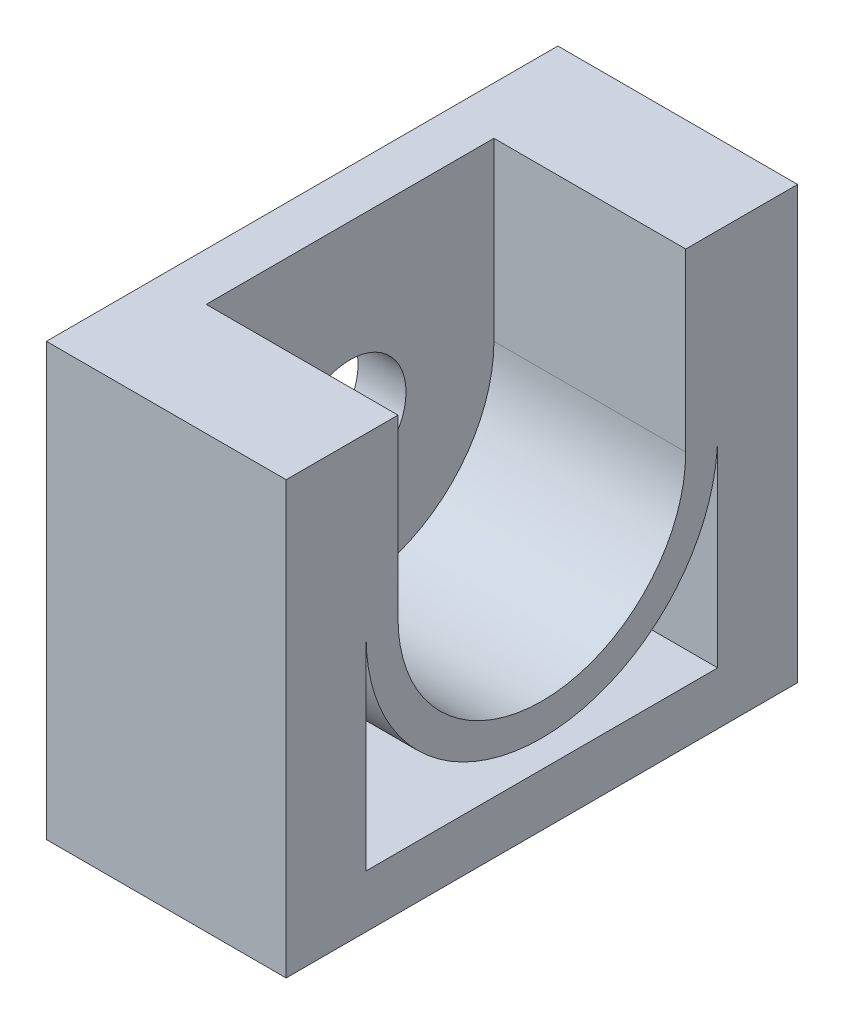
ISO-10303-21;
HEADER;
FILE_DESCRIPTION(('STEP AP214'),'2;1');
FILE_NAME('part.step','',(''),(''),'','','');
FILE_SCHEMA(('AUTOMOTIVE_DESIGN { 1 0 10303 214 1 1 1 1 }'));
ENDSEC;
DATA;
#1=APPLICATION_CONTEXT('core data for automotive mechanical design processes');
#2=APPLICATION_PROTOCOL_DEFINITION('international standard','automotive_design',2000,#1);
#3=PRODUCT_CONTEXT('',#1,'mechanical');
#4=PRODUCT('Part','Part','',(#3));
#5=PRODUCT_RELATED_PRODUCT_CATEGORY('part','',(#4));
#6=PRODUCT_DEFINITION_FORMATION('','',#4);
#7=PRODUCT_DEFINITION_CONTEXT('part definition',#1,'design');
#8=PRODUCT_DEFINITION('design','',#6,#7);
#9=PRODUCT_DEFINITION_SHAPE('','',#8);
#10=(LENGTH_UNIT() NAMED_UNIT(*) SI_UNIT(.MILLI.,.METRE.));
#11=(NAMED_UNIT(*) PLANE_ANGLE_UNIT() SI_UNIT($,.RADIAN.));
#12=(NAMED_UNIT(*) SI_UNIT($,.STERADIAN.) SOLID_ANGLE_UNIT());
#13=UNCERTAINTY_MEASURE_WITH_UNIT(LENGTH_MEASURE(1.E-05),#10,'distance_accuracy_value','');
#14=(GEOMETRIC_REPRESENTATION_CONTEXT(3) GLOBAL_UNCERTAINTY_ASSIGNED_CONTEXT((#13)) GLOBAL_UNIT_ASSIGNED_CONTEXT((#10,
#11,#12)) REPRESENTATION_CONTEXT('',''));
#15=CARTESIAN_POINT('',(0.,0.,0.));
#16=DIRECTION('',(0.,0.,1.));
#17=DIRECTION('',(1.,0.,0.));
#18=AXIS2_PLACEMENT_3D('',#15,#16,#17);
#19=CARTESIAN_POINT('',(15.,11.,11.));
#20=DIRECTION('',(0.,-1.,0.));
#21=DIRECTION('',(0.,0.,-1.));
#22=AXIS2_PLACEMENT_3D('',#19,#20,#21);
#23=PLANE('',#22);
#24=DIRECTION('',(1.,0.,0.));
#25=VECTOR('',#24,1.);
#26=CARTESIAN_POINT('',(3.,11.,9.));
#27=LINE('',#26,#25);
#28=CARTESIAN_POINT('',(3.,11.,9.));
#29=VERTEX_POINT('',#28);
#30=CARTESIAN_POINT('',(15.,11.,9.));
#31=VERTEX_POINT('',#30);
#32=EDGE_CURVE('E247',#29,#31,#27,.T.);
#33=ORIENTED_EDGE('',*,*,#32,.F.);
#34=DIRECTION('',(0.,0.,-1.));
#35=VECTOR('',#34,1.);
#36=CARTESIAN_POINT('',(3.,11.,9.));
#37=LINE('',#36,#35);
#38=CARTESIAN_POINT('',(3.,11.,-9.));
#39=VERTEX_POINT('',#38);
#40=EDGE_CURVE('E214',#29,#39,#37,.T.);
#41=ORIENTED_EDGE('',*,*,#40,.T.);
#42=DIRECTION('',(1.,0.,0.));
#43=VECTOR('',#42,1.);
#44=CARTESIAN_POINT('',(3.,11.,-9.));
#45=LINE('',#44,#43);
#46=CARTESIAN_POINT('',(15.,11.,-9.));
#47=VERTEX_POINT('',#46);
#48=EDGE_CURVE('E243',#39,#47,#45,.T.);
#49=ORIENTED_EDGE('',*,*,#48,.T.);
#50=DIRECTION('',(0.,0.,1.));
#51=VECTOR('',#50,1.);
#52=CARTESIAN_POINT('',(15.,11.,11.));
#53=LINE('',#52,#51);
#54=CARTESIAN_POINT('',(15.,11.,-16.));
#55=VERTEX_POINT('',#54);
#56=EDGE_CURVE('E256',#55,#47,#53,.T.);
#57=ORIENTED_EDGE('',*,*,#56,.F.);
#58=DIRECTION('',(-1.,0.,0.));
#59=VECTOR('',#58,1.);
#60=CARTESIAN_POINT('',(15.,11.,-16.));
#61=LINE('',#60,#59);
#62=CARTESIAN_POINT('',(0.,11.,-16.));
#63=VERTEX_POINT('',#62);
#64=EDGE_CURVE('E194',#55,#63,#61,.T.);
#65=ORIENTED_EDGE('',*,*,#64,.T.);
#66=DIRECTION('',(0.,0.,1.));
#67=VECTOR('',#66,1.);
#68=CARTESIAN_POINT('',(0.,11.,11.));
#69=LINE('',#68,#67);
#70=CARTESIAN_POINT('',(0.,11.,16.));
#71=VERTEX_POINT('',#70);
#72=EDGE_CURVE('E255',#63,#71,#69,.T.);
#73=ORIENTED_EDGE('',*,*,#72,.T.);
#74=DIRECTION('',(1.,0.,0.));
#75=VECTOR('',#74,1.);
#76=CARTESIAN_POINT('',(0.,11.,16.));
#77=LINE('',#76,#75);
#78=CARTESIAN_POINT('',(15.,11.,16.));
#79=VERTEX_POINT('',#78);
#80=EDGE_CURVE('E166',#71,#79,#77,.T.);
#81=ORIENTED_EDGE('',*,*,#80,.T.);
#82=EDGE_CURVE('E254',#31,#79,#53,.T.);
#83=ORIENTED_EDGE('',*,*,#82,.F.);
#84=EDGE_LOOP('',(#33,#41,#49,#57,#65,#73,#81,#83));
#85=FACE_BOUND('',#84,.T.);
#86=ADVANCED_FACE('F42',(#85),#23,.F.);
#87=CARTESIAN_POINT('',(15.,0.,0.));
#88=DIRECTION('',(1.,0.,0.));
#89=DIRECTION('',(0.,0.,-1.));
#90=AXIS2_PLACEMENT_3D('',#87,#88,#89);
#91=PLANE('',#90);
#92=DIRECTION('',(0.,1.,0.));
#93=VECTOR('',#92,1.);
#94=CARTESIAN_POINT('',(15.,-16.,-11.));
#95=LINE('',#94,#93);
#96=CARTESIAN_POINT('',(15.,-12.6971911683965,-11.));
#97=VERTEX_POINT('',#96);
#98=CARTESIAN_POINT('',(15.,0.,-11.));
#99=VERTEX_POINT('',#98);
#100=EDGE_CURVE('E188',#97,#99,#95,.T.);
#101=ORIENTED_EDGE('',*,*,#100,.F.);
#102=DIRECTION('',(0.,0.,1.));
#103=VECTOR('',#102,1.);
#104=CARTESIAN_POINT('',(15.,-12.6971911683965,-26.3593146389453));
#105=LINE('',#104,#103);
#106=CARTESIAN_POINT('',(15.,-12.6971911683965,11.));
#107=VERTEX_POINT('',#106);
#108=EDGE_CURVE('E138',#97,#107,#105,.T.);
#109=ORIENTED_EDGE('',*,*,#108,.T.);
#110=DIRECTION('',(0.,1.,0.));
#111=VECTOR('',#110,1.);
#112=CARTESIAN_POINT('',(15.,-16.,11.));
#113=LINE('',#112,#111);
#114=CARTESIAN_POINT('',(15.,0.,11.));
#115=VERTEX_POINT('',#114);
#116=EDGE_CURVE('E145',#107,#115,#113,.T.);
#117=ORIENTED_EDGE('',*,*,#116,.T.);
#118=CARTESIAN_POINT('',(15.,0.,0.));
#119=DIRECTION('',(1.,0.,0.));
#120=DIRECTION('',(0.,0.,-1.));
#121=AXIS2_PLACEMENT_3D('',#118,#119,#120);
#122=CIRCLE('',#121,11.);
#123=EDGE_CURVE('E250',#115,#99,#122,.T.);
#124=ORIENTED_EDGE('',*,*,#123,.T.);
#125=EDGE_LOOP('',(#101,#109,#117,#124));
#126=FACE_BOUND('',#125,.T.);
#127=CARTESIAN_POINT('',(15.,0.,0.));
#128=DIRECTION('',(1.,0.,0.));
#129=DIRECTION('',(0.,0.,-1.));
#130=AXIS2_PLACEMENT_3D('',#127,#128,#129);
#131=CIRCLE('',#130,9.);
#132=CARTESIAN_POINT('',(15.,0.,9.));
#133=VERTEX_POINT('',#132);
#134=CARTESIAN_POINT('',(15.,0.,-9.));
#135=VERTEX_POINT('',#134);
#136=EDGE_CURVE('E215',#133,#135,#131,.T.);
#137=ORIENTED_EDGE('',*,*,#136,.F.);
#138=DIRECTION('',(0.,1.,0.));
#139=VECTOR('',#138,1.);
#140=CARTESIAN_POINT('',(15.,0.,9.));
#141=LINE('',#140,#139);
#142=EDGE_CURVE('E206',#133,#31,#141,.T.);
#143=ORIENTED_EDGE('',*,*,#142,.T.);
#144=ORIENTED_EDGE('',*,*,#82,.T.);
#145=DIRECTION('',(0.,-1.,0.));
#146=VECTOR('',#145,1.);
#147=CARTESIAN_POINT('',(15.,11.,16.));
#148=LINE('',#147,#146);
#149=CARTESIAN_POINT('',(15.,-16.,16.));
#150=VERTEX_POINT('',#149);
#151=EDGE_CURVE('E158',#79,#150,#148,.T.);
#152=ORIENTED_EDGE('',*,*,#151,.T.);
#153=DIRECTION('',(0.,0.,-1.));
#154=VECTOR('',#153,1.);
#155=CARTESIAN_POINT('',(15.,-16.,-11.));
#156=LINE('',#155,#154);
#157=CARTESIAN_POINT('',(15.,-16.,-16.));
#158=VERTEX_POINT('',#157);
#159=EDGE_CURVE('E178',#150,#158,#156,.T.);
#160=ORIENTED_EDGE('',*,*,#159,.T.);
#161=DIRECTION('',(0.,-1.,0.));
#162=VECTOR('',#161,1.);
#163=CARTESIAN_POINT('',(15.,11.,-16.));
#164=LINE('',#163,#162);
#165=EDGE_CURVE('E198',#55,#158,#164,.T.);
#166=ORIENTED_EDGE('',*,*,#165,.F.);
#167=ORIENTED_EDGE('',*,*,#56,.T.);
#168=DIRECTION('',(0.,1.,0.));
#169=VECTOR('',#168,1.);
#170=CARTESIAN_POINT('',(15.,0.,-9.));
#171=LINE('',#170,#169);
#172=EDGE_CURVE('E231',#135,#47,#171,.T.);
#173=ORIENTED_EDGE('',*,*,#172,.F.);
#174=EDGE_LOOP('',(#137,#143,#144,#152,#160,#166,#167,#173));
#175=FACE_BOUND('',#174,.T.);
#176=ADVANCED_FACE('F268',(#126,#175),#91,.T.);
#177=CARTESIAN_POINT('',(15.,0.,0.));
#178=DIRECTION('',(-1.,0.,0.));
#179=DIRECTION('',(0.,0.,1.));
#180=AXIS2_PLACEMENT_3D('',#177,#178,#179);
#181=CYLINDRICAL_SURFACE('',#180,11.);
#182=CARTESIAN_POINT('',(0.,0.,0.));
#183=DIRECTION('',(1.,0.,0.));
#184=DIRECTION('',(0.,0.,-1.));
#185=AXIS2_PLACEMENT_3D('',#182,#183,#184);
#186=CIRCLE('',#185,11.);
#187=CARTESIAN_POINT('',(0.,0.,11.));
#188=VERTEX_POINT('',#187);
#189=CARTESIAN_POINT('',(0.,0.,-11.));
#190=VERTEX_POINT('',#189);
#191=EDGE_CURVE('E151',#188,#190,#186,.T.);
#192=ORIENTED_EDGE('',*,*,#191,.T.);
#193=DIRECTION('',(-1.,0.,0.));
#194=VECTOR('',#193,1.);
#195=CARTESIAN_POINT('',(15.,0.,-11.));
#196=LINE('',#195,#194);
#197=EDGE_CURVE('E11',#99,#190,#196,.T.);
#198=ORIENTED_EDGE('',*,*,#197,.F.);
#199=ORIENTED_EDGE('',*,*,#123,.F.);
#200=DIRECTION('',(-1.,0.,0.));
#201=VECTOR('',#200,1.);
#202=CARTESIAN_POINT('',(15.,0.,11.));
#203=LINE('',#202,#201);
#204=EDGE_CURVE('E51',#115,#188,#203,.T.);
#205=ORIENTED_EDGE('',*,*,#204,.T.);
#206=EDGE_LOOP('',(#192,#198,#199,#205));
#207=FACE_BOUND('',#206,.T.);
#208=ADVANCED_FACE('F44',(#207),#181,.T.);
#209=CARTESIAN_POINT('',(0.,0.,0.));
#210=DIRECTION('',(1.,0.,0.));
#211=DIRECTION('',(0.,0.,-1.));
#212=AXIS2_PLACEMENT_3D('',#209,#210,#211);
#213=PLANE('',#212);
#214=DIRECTION('',(0.,0.,1.));
#215=VECTOR('',#214,1.);
#216=CARTESIAN_POINT('',(0.,-12.6971911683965,-26.3593146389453));
#217=LINE('',#216,#215);
#218=CARTESIAN_POINT('',(0.,-12.6971911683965,-11.));
#219=VERTEX_POINT('',#218);
#220=CARTESIAN_POINT('',(0.,-12.6971911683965,11.));
#221=VERTEX_POINT('',#220);
#222=EDGE_CURVE('E129',#219,#221,#217,.T.);
#223=ORIENTED_EDGE('',*,*,#222,.F.);
#224=DIRECTION('',(0.,1.,0.));
#225=VECTOR('',#224,1.);
#226=CARTESIAN_POINT('',(0.,-16.,-11.));
#227=LINE('',#226,#225);
#228=EDGE_CURVE('E62',#219,#190,#227,.T.);
#229=ORIENTED_EDGE('',*,*,#228,.T.);
#230=ORIENTED_EDGE('',*,*,#191,.F.);
#231=DIRECTION('',(0.,1.,0.));
#232=VECTOR('',#231,1.);
#233=CARTESIAN_POINT('',(0.,-16.,11.));
#234=LINE('',#233,#232);
#235=EDGE_CURVE('E143',#221,#188,#234,.T.);
#236=ORIENTED_EDGE('',*,*,#235,.F.);
#237=EDGE_LOOP('',(#223,#229,#230,#236));
#238=FACE_BOUND('',#237,.T.);
#239=CARTESIAN_POINT('',(0.,0.,0.));
#240=DIRECTION('',(1.,0.,0.));
#241=DIRECTION('',(0.,0.,-1.));
#242=AXIS2_PLACEMENT_3D('',#239,#240,#241);
#243=CIRCLE('',#242,3.5);
#244=CARTESIAN_POINT('',(0.,0.,-3.5));
#245=VERTEX_POINT('',#244);
#246=EDGE_CURVE('E202',#245,#245,#243,.T.);
#247=ORIENTED_EDGE('',*,*,#246,.T.);
#248=EDGE_LOOP('',(#247));
#249=FACE_BOUND('',#248,.T.);
#250=DIRECTION('',(0.,0.,-1.));
#251=VECTOR('',#250,1.);
#252=CARTESIAN_POINT('',(0.,-16.,-11.));
#253=LINE('',#252,#251);
#254=CARTESIAN_POINT('',(0.,-16.,16.));
#255=VERTEX_POINT('',#254);
#256=CARTESIAN_POINT('',(0.,-16.,-16.));
#257=VERTEX_POINT('',#256);
#258=EDGE_CURVE('E182',#255,#257,#253,.T.);
#259=ORIENTED_EDGE('',*,*,#258,.F.);
#260=DIRECTION('',(0.,-1.,0.));
#261=VECTOR('',#260,1.);
#262=CARTESIAN_POINT('',(0.,11.,16.));
#263=LINE('',#262,#261);
#264=EDGE_CURVE('E170',#71,#255,#263,.T.);
#265=ORIENTED_EDGE('',*,*,#264,.F.);
#266=ORIENTED_EDGE('',*,*,#72,.F.);
#267=DIRECTION('',(0.,-1.,0.));
#268=VECTOR('',#267,1.);
#269=CARTESIAN_POINT('',(0.,11.,-16.));
#270=LINE('',#269,#268);
#271=EDGE_CURVE('E191',#63,#257,#270,.T.);
#272=ORIENTED_EDGE('',*,*,#271,.T.);
#273=EDGE_LOOP('',(#259,#265,#266,#272));
#274=FACE_BOUND('',#273,.T.);
#275=ADVANCED_FACE('F148',(#238,#249,#274),#213,.F.);
#276=CARTESIAN_POINT('',(3.,0.,9.));
#277=DIRECTION('',(0.,0.,-1.));
#278=DIRECTION('',(-1.,0.,0.));
#279=AXIS2_PLACEMENT_3D('',#276,#277,#278);
#280=PLANE('',#279);
#281=ORIENTED_EDGE('',*,*,#142,.F.);
#282=DIRECTION('',(1.,0.,0.));
#283=VECTOR('',#282,1.);
#284=CARTESIAN_POINT('',(3.,0.,9.));
#285=LINE('',#284,#283);
#286=CARTESIAN_POINT('',(3.,0.,9.));
#287=VERTEX_POINT('',#286);
#288=EDGE_CURVE('E227',#287,#133,#285,.T.);
#289=ORIENTED_EDGE('',*,*,#288,.F.);
#290=DIRECTION('',(0.,1.,0.));
#291=VECTOR('',#290,1.);
#292=CARTESIAN_POINT('',(3.,0.,9.));
#293=LINE('',#292,#291);
#294=EDGE_CURVE('E210',#287,#29,#293,.T.);
#295=ORIENTED_EDGE('',*,*,#294,.T.);
#296=ORIENTED_EDGE('',*,*,#32,.T.);
#297=EDGE_LOOP('',(#281,#289,#295,#296));
#298=FACE_BOUND('',#297,.T.);
#299=ADVANCED_FACE('F298',(#298),#280,.T.);
#300=CARTESIAN_POINT('',(3.,0.,-9.));
#301=DIRECTION('',(0.,0.,-1.));
#302=DIRECTION('',(-1.,0.,0.));
#303=AXIS2_PLACEMENT_3D('',#300,#301,#302);
#304=PLANE('',#303);
#305=ORIENTED_EDGE('',*,*,#172,.T.);
#306=ORIENTED_EDGE('',*,*,#48,.F.);
#307=DIRECTION('',(0.,1.,0.));
#308=VECTOR('',#307,1.);
#309=CARTESIAN_POINT('',(3.,0.,-9.));
#310=LINE('',#309,#308);
#311=CARTESIAN_POINT('',(3.,0.,-9.));
#312=VERTEX_POINT('',#311);
#313=EDGE_CURVE('E219',#312,#39,#310,.T.);
#314=ORIENTED_EDGE('',*,*,#313,.F.);
#315=DIRECTION('',(1.,0.,0.));
#316=VECTOR('',#315,1.);
#317=CARTESIAN_POINT('',(3.,0.,-9.));
#318=LINE('',#317,#316);
#319=EDGE_CURVE('E240',#312,#135,#318,.T.);
#320=ORIENTED_EDGE('',*,*,#319,.T.);
#321=EDGE_LOOP('',(#305,#306,#314,#320));
#322=FACE_BOUND('',#321,.T.);
#323=ADVANCED_FACE('F302',(#322),#304,.F.);
#324=CARTESIAN_POINT('',(3.,0.,0.));
#325=DIRECTION('',(1.,0.,0.));
#326=DIRECTION('',(0.,0.,-1.));
#327=AXIS2_PLACEMENT_3D('',#324,#325,#326);
#328=CYLINDRICAL_SURFACE('',#327,9.);
#329=ORIENTED_EDGE('',*,*,#136,.T.);
#330=ORIENTED_EDGE('',*,*,#319,.F.);
#331=CARTESIAN_POINT('',(3.,0.,0.));
#332=DIRECTION('',(1.,0.,0.));
#333=DIRECTION('',(0.,0.,-1.));
#334=AXIS2_PLACEMENT_3D('',#331,#332,#333);
#335=CIRCLE('',#334,9.);
#336=EDGE_CURVE('E223',#287,#312,#335,.T.);
#337=ORIENTED_EDGE('',*,*,#336,.F.);
#338=ORIENTED_EDGE('',*,*,#288,.T.);
#339=EDGE_LOOP('',(#329,#330,#337,#338));
#340=FACE_BOUND('',#339,.T.);
#341=ADVANCED_FACE('F306',(#340),#328,.F.);
#342=CARTESIAN_POINT('',(3.,0.,0.));
#343=DIRECTION('',(1.,0.,0.));
#344=DIRECTION('',(0.,0.,-1.));
#345=AXIS2_PLACEMENT_3D('',#342,#343,#344);
#346=PLANE('',#345);
#347=CARTESIAN_POINT('',(3.,0.,0.));
#348=DIRECTION('',(1.,0.,0.));
#349=DIRECTION('',(0.,0.,-1.));
#350=AXIS2_PLACEMENT_3D('',#347,#348,#349);
#351=CIRCLE('',#350,3.5);
#352=CARTESIAN_POINT('',(3.,0.,-3.5));
#353=VERTEX_POINT('',#352);
#354=EDGE_CURVE('E201',#353,#353,#351,.T.);
#355=ORIENTED_EDGE('',*,*,#354,.F.);
#356=EDGE_LOOP('',(#355));
#357=FACE_BOUND('',#356,.T.);
#358=ORIENTED_EDGE('',*,*,#294,.F.);
#359=ORIENTED_EDGE('',*,*,#336,.T.);
#360=ORIENTED_EDGE('',*,*,#313,.T.);
#361=ORIENTED_EDGE('',*,*,#40,.F.);
#362=EDGE_LOOP('',(#358,#359,#360,#361));
#363=FACE_BOUND('',#362,.T.);
#364=ADVANCED_FACE('F310',(#357,#363),#346,.T.);
#365=CARTESIAN_POINT('',(0.,0.,0.));
#366=DIRECTION('',(1.,0.,0.));
#367=DIRECTION('',(0.,0.,-1.));
#368=AXIS2_PLACEMENT_3D('',#365,#366,#367);
#369=CYLINDRICAL_SURFACE('',#368,3.5);
#370=ORIENTED_EDGE('',*,*,#246,.F.);
#371=EDGE_LOOP('',(#370));
#372=FACE_BOUND('',#371,.T.);
#373=ORIENTED_EDGE('',*,*,#354,.T.);
#374=EDGE_LOOP('',(#373));
#375=FACE_BOUND('',#374,.T.);
#376=ADVANCED_FACE('F286',(#372,#375),#369,.F.);
#377=CARTESIAN_POINT('',(0.,0.,-16.));
#378=DIRECTION('',(0.,0.,1.));
#379=DIRECTION('',(1.,0.,0.));
#380=AXIS2_PLACEMENT_3D('',#377,#378,#379);
#381=PLANE('',#380);
#382=ORIENTED_EDGE('',*,*,#165,.T.);
#383=DIRECTION('',(1.,0.,0.));
#384=VECTOR('',#383,1.);
#385=CARTESIAN_POINT('',(0.,-16.,-16.));
#386=LINE('',#385,#384);
#387=EDGE_CURVE('E174',#257,#158,#386,.T.);
#388=ORIENTED_EDGE('',*,*,#387,.F.);
#389=ORIENTED_EDGE('',*,*,#271,.F.);
#390=ORIENTED_EDGE('',*,*,#64,.F.);
#391=EDGE_LOOP('',(#382,#388,#389,#390));
#392=FACE_BOUND('',#391,.T.);
#393=ADVANCED_FACE('F277',(#392),#381,.F.);
#394=CARTESIAN_POINT('',(0.,-16.,-11.));
#395=DIRECTION('',(0.,0.,1.));
#396=DIRECTION('',(1.,0.,0.));
#397=AXIS2_PLACEMENT_3D('',#394,#395,#396);
#398=PLANE('',#397);
#399=DIRECTION('',(1.,0.,0.));
#400=VECTOR('',#399,1.);
#401=CARTESIAN_POINT('',(15.,-12.6971911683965,-11.));
#402=LINE('',#401,#400);
#403=EDGE_CURVE('E58',#219,#97,#402,.T.);
#404=ORIENTED_EDGE('',*,*,#403,.T.);
#405=ORIENTED_EDGE('',*,*,#100,.T.);
#406=ORIENTED_EDGE('',*,*,#197,.T.);
#407=ORIENTED_EDGE('',*,*,#228,.F.);
#408=EDGE_LOOP('',(#404,#405,#406,#407));
#409=FACE_BOUND('',#408,.T.);
#410=ADVANCED_FACE('F274',(#409),#398,.T.);
#411=CARTESIAN_POINT('',(0.,-16.,0.));
#412=DIRECTION('',(0.,1.,0.));
#413=DIRECTION('',(0.,0.,1.));
#414=AXIS2_PLACEMENT_3D('',#411,#412,#413);
#415=PLANE('',#414);
#416=ORIENTED_EDGE('',*,*,#387,.T.);
#417=ORIENTED_EDGE('',*,*,#159,.F.);
#418=DIRECTION('',(1.,0.,0.));
#419=VECTOR('',#418,1.);
#420=CARTESIAN_POINT('',(0.,-16.,16.));
#421=LINE('',#420,#419);
#422=EDGE_CURVE('E154',#255,#150,#421,.T.);
#423=ORIENTED_EDGE('',*,*,#422,.F.);
#424=ORIENTED_EDGE('',*,*,#258,.T.);
#425=EDGE_LOOP('',(#416,#417,#423,#424));
#426=FACE_BOUND('',#425,.T.);
#427=ADVANCED_FACE('F276',(#426),#415,.F.);
#428=CARTESIAN_POINT('',(0.,0.,16.));
#429=DIRECTION('',(0.,0.,-1.));
#430=DIRECTION('',(-1.,0.,0.));
#431=AXIS2_PLACEMENT_3D('',#428,#429,#430);
#432=PLANE('',#431);
#433=ORIENTED_EDGE('',*,*,#264,.T.);
#434=ORIENTED_EDGE('',*,*,#422,.T.);
#435=ORIENTED_EDGE('',*,*,#151,.F.);
#436=ORIENTED_EDGE('',*,*,#80,.F.);
#437=EDGE_LOOP('',(#433,#434,#435,#436));
#438=FACE_BOUND('',#437,.T.);
#439=ADVANCED_FACE('F283',(#438),#432,.F.);
#440=CARTESIAN_POINT('',(0.,-16.,11.));
#441=DIRECTION('',(0.,0.,1.));
#442=DIRECTION('',(1.,0.,0.));
#443=AXIS2_PLACEMENT_3D('',#440,#441,#442);
#444=PLANE('',#443);
#445=ORIENTED_EDGE('',*,*,#116,.F.);
#446=DIRECTION('',(-1.,0.,0.));
#447=VECTOR('',#446,1.);
#448=CARTESIAN_POINT('',(15.,-12.6971911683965,11.));
#449=LINE('',#448,#447);
#450=EDGE_CURVE('E133',#107,#221,#449,.T.);
#451=ORIENTED_EDGE('',*,*,#450,.T.);
#452=ORIENTED_EDGE('',*,*,#235,.T.);
#453=ORIENTED_EDGE('',*,*,#204,.F.);
#454=EDGE_LOOP('',(#445,#451,#452,#453));
#455=FACE_BOUND('',#454,.T.);
#456=ADVANCED_FACE('F141',(#455),#444,.F.);
#457=CARTESIAN_POINT('',(15.,-12.6971911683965,-26.3593146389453));
#458=DIRECTION('',(0.,1.,0.));
#459=DIRECTION('',(0.,0.,1.));
#460=AXIS2_PLACEMENT_3D('',#457,#458,#459);
#461=PLANE('',#460);
#462=ORIENTED_EDGE('',*,*,#403,.F.);
#463=ORIENTED_EDGE('',*,*,#222,.T.);
#464=ORIENTED_EDGE('',*,*,#450,.F.);
#465=ORIENTED_EDGE('',*,*,#108,.F.);
#466=EDGE_LOOP('',(#462,#463,#464,#465));
#467=FACE_BOUND('',#466,.T.);
#468=ADVANCED_FACE('F131',(#467),#461,.T.);
#469=CLOSED_SHELL('',(#86,#176,#208,#275,#299,#323,#341,#364,#376,#393,#410,#427,#439,#456,#468));
#470=MANIFOLD_SOLID_BREP('B2',#469);
#471=ADVANCED_BREP_SHAPE_REPRESENTATION('',(#18,#470),#14);
#472=SHAPE_DEFINITION_REPRESENTATION(#9,#471);
ENDSEC;
END-ISO-10303-21;
